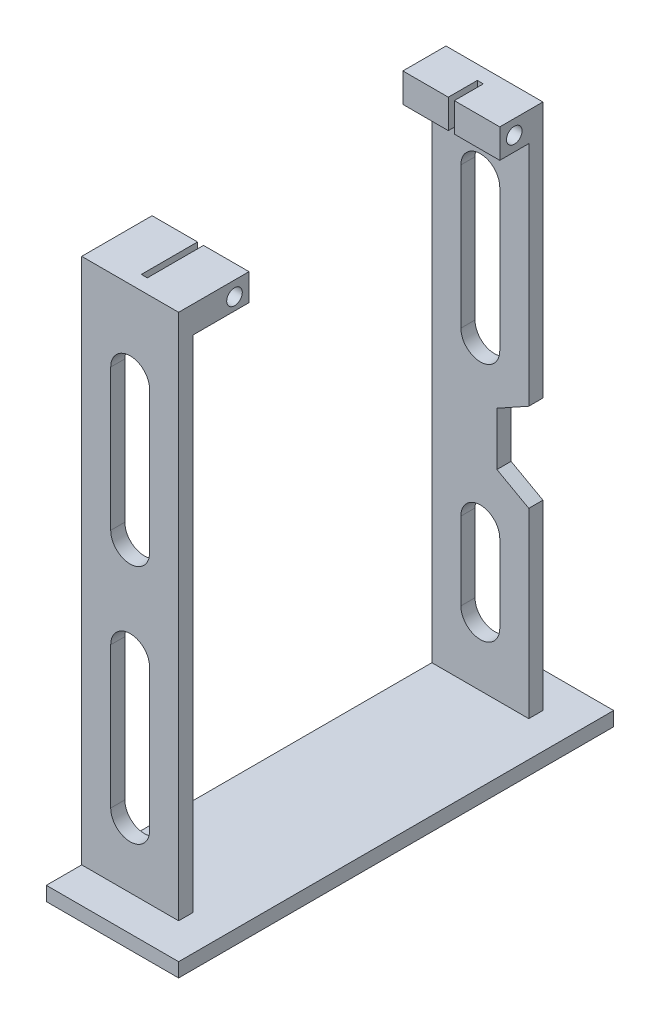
from build123d import *

# Parameters (mm, degrees)
SKETCH2_W           = 27.4
SKETCH2_H           = 103
BOSS_EXTRUDE1_DEPTH = 2
SKETCH3_W           = 27.4
SKETCH3_H           = 4
BOSS_EXTRUDE2_DEPTH = 149
SKETCH4_W           = 27.4
SKETCH4_H           = 4
BOSS_EXTRUDE3_DEPTH = 149
SKETCH5_W           = 12.85
SKETCH5_H           = 7.6
BOSS_EXTRUDE4_DEPTH = 19.9
SKETCH8_W           = 12.85
SKETCH8_H           = 8.2
BOSS_EXTRUDE5_DEPTH = 12.2
SKETCH10_R          = 2.2
CUT_EXTRUDE1_DEPTH  = 30
SKETCH9_R           = 2.2
CUT_EXTRUDE2_DEPTH  = 30
SKETCH13_W          = 103
SKETCH13_H          = 2
BOSS_EXTRUDE6_DEPTH = 27.4
SKETCH15_W          = 10
SKETCH15_H          = 4
BOSS_EXTRUDE7_DEPTH = 27.4
SKETCH16_W          = 10
SKETCH16_H          = 4
BOSS_EXTRUDE8_DEPTH = 27.4
SKETCH26_W          = 10
SKETCH26_H          = 123
BOSS_EXTRUDE9_DEPTH = 4
CUT_EXTRUDE5_DEPTH  = 14
CUT_EXTRUDE8_DEPTH  = 14
CUT_EXTRUDE7_START  = -14
CUT_EXTRUDE7_DEPTH  = 14


with BuildPart() as part:
    # Sketch2 → Boss-Extrude1 (new body)
    with BuildSketch(Plane(origin=(0, 0, 0), x_dir=(1, 0, 0), z_dir=(0, 1, 0))):
        with Locations((0, 2.5)):
            Rectangle(SKETCH2_W, SKETCH2_H)
    extrude(amount=BOSS_EXTRUDE1_DEPTH)

    # Sketch3 → Boss-Extrude2 (add)
    with BuildSketch(Plane(origin=(0, 2, 0), x_dir=(1, 0, 0), z_dir=(0, 1, 0))):
        with Locations((0, -47)):
            Rectangle(SKETCH3_W, SKETCH3_H)
    extrude(amount=BOSS_EXTRUDE2_DEPTH)

    # Sketch4 → Boss-Extrude3 (add)
    with BuildSketch(Plane(origin=(0, 2, 0), x_dir=(1, 0, 0), z_dir=(0, 1, 0))):
        with Locations((0, 52)):
            Rectangle(SKETCH4_W, SKETCH4_H)
    extrude(amount=BOSS_EXTRUDE3_DEPTH)

    # Sketch5 → Boss-Extrude4 (add)
    with BuildSketch(Plane.XY.offset(49)):
        with Locations((-7.275, 147.2)):
            Rectangle(SKETCH5_W, SKETCH5_H)
        with Locations((7.275, 147.2)):
            Rectangle(SKETCH5_W, SKETCH5_H)
    extrude(amount=-BOSS_EXTRUDE4_DEPTH)

    # Sketch8 → Boss-Extrude5 (add)
    with BuildSketch(Plane(origin=(0, 0, -54), x_dir=(-1, 0, 0), z_dir=(0, 0, -1))):
        with Locations((-7.275, 146.9)):
            Rectangle(SKETCH8_W, SKETCH8_H)
        with Locations((7.275, 146.9)):
            Rectangle(SKETCH8_W, SKETCH8_H)
    extrude(amount=-BOSS_EXTRUDE5_DEPTH)

    # Sketch10 → Cut-Extrude1 (cut)
    with BuildSketch(Plane(origin=(13.7, 0, 0), x_dir=(0, 0, -1), z_dir=(1, 0, 0))):
        with Locations((-33.2, 146.9)):
            Circle(SKETCH10_R)
    extrude(amount=-CUT_EXTRUDE1_DEPTH, mode=Mode.SUBTRACT)

    # Sketch9 → Cut-Extrude2 (cut)
    with BuildSketch(Plane(origin=(13.7, 0, 0), x_dir=(0, 0, -1), z_dir=(1, 0, 0))):
        with Locations((45.9, 146.9)):
            Circle(SKETCH9_R)
    extrude(amount=-CUT_EXTRUDE2_DEPTH, mode=Mode.SUBTRACT)

    # Sketch13 → Boss-Extrude6 (add)
    with BuildSketch(Plane.ZY.offset(13.7)):
        with Locations((-2.5, -1)):
            Rectangle(SKETCH13_W, SKETCH13_H)
    extrude(amount=-BOSS_EXTRUDE6_DEPTH)

    # Sketch15 → Boss-Extrude7 (add)
    with BuildSketch(Plane(origin=(13.7, 0, 0), x_dir=(0, 0, -1), z_dir=(1, 0, 0))):
        with Locations((-54, 0)):
            Rectangle(SKETCH15_W, SKETCH15_H)
    extrude(amount=-BOSS_EXTRUDE7_DEPTH)

    # Sketch16 → Boss-Extrude8 (add)
    with BuildSketch(Plane(origin=(13.7, 0, 0), x_dir=(0, 0, -1), z_dir=(1, 0, 0))):
        with Locations((59, 0)):
            Rectangle(SKETCH16_W, SKETCH16_H)
    extrude(amount=-BOSS_EXTRUDE8_DEPTH)

    # Sketch26 → Boss-Extrude9 (add)
    with BuildSketch(Plane(origin=(0, 2, 0), x_dir=(1, 0, 0), z_dir=(0, 1, 0))):
        with Locations((18.7, 2.5)):
            Rectangle(SKETCH26_W, SKETCH26_H)
    extrude(amount=-BOSS_EXTRUDE9_DEPTH)

    # Sketch22 → Cut-Extrude5 (cut)
    with BuildSketch(Plane(origin=(0, 0, -54), x_dir=(-1, 0, 0), z_dir=(0, 0, -1))):
        Polygon((-13.7, 53.5), (-4.7, 58.5), (-4.7, 73.5), (-13.7, 78.5), align=None)
    extrude(amount=-CUT_EXTRUDE5_DEPTH, mode=Mode.SUBTRACT)

    # Sketch29 → Cut-Extrude8 (cut)
    with BuildSketch(Plane.XY.offset(49)):
        with BuildLine():
            Line((-5.5, 20.013396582), (-5.5, 59.986603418))
            ThreePointArc((-5.5, 59.986603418), (0, 65.486603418), (5.5, 59.986603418))
            Line((5.5, 59.986603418), (5.5, 20.013396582))
            ThreePointArc((5.5, 20.013396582), (0, 14.513396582), (-5.5, 20.013396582))
        make_face()
        with BuildLine():
            Line((5.5, 127.986603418), (5.5, 88.013396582))
            ThreePointArc((5.5, 88.013396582), (0, 82.513396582), (-5.5, 88.013396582))
            Line((-5.5, 88.013396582), (-5.5, 127.986603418))
            ThreePointArc((-5.5, 127.986603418), (0, 133.486603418), (5.5, 127.986603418))
        make_face()
    extrude(amount=-CUT_EXTRUDE8_DEPTH, mode=Mode.SUBTRACT)

    # Sketch25 → Cut-Extrude7 (cut)
    with BuildSketch(Plane(origin=(0, 0, -54), x_dir=(-1, 0, 0), z_dir=(0, 0, -1)).offset(CUT_EXTRUDE7_START)):
        with BuildLine():
            Line((5.5, 41.986603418), (5.5, 20.013396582))
            ThreePointArc((5.5, 20.013396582), (0, 14.513396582), (-5.5, 20.013396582))
            Line((-5.5, 20.013396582), (-5.5, 41.986603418))
            ThreePointArc((-5.5, 41.986603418), (0, 47.486603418), (5.5, 41.986603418))
        make_face()
        with BuildLine():
            Line((5.5, 127.986603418), (5.5, 88.013396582))
            ThreePointArc((5.5, 88.013396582), (0, 82.513396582), (-5.5, 88.013396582))
            Line((-5.5, 88.013396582), (-5.5, 127.986603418))
            ThreePointArc((-5.5, 127.986603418), (0, 133.486603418), (5.5, 127.986603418))
        make_face()
    extrude(amount=CUT_EXTRUDE7_DEPTH, mode=Mode.SUBTRACT)


solid = part.part
